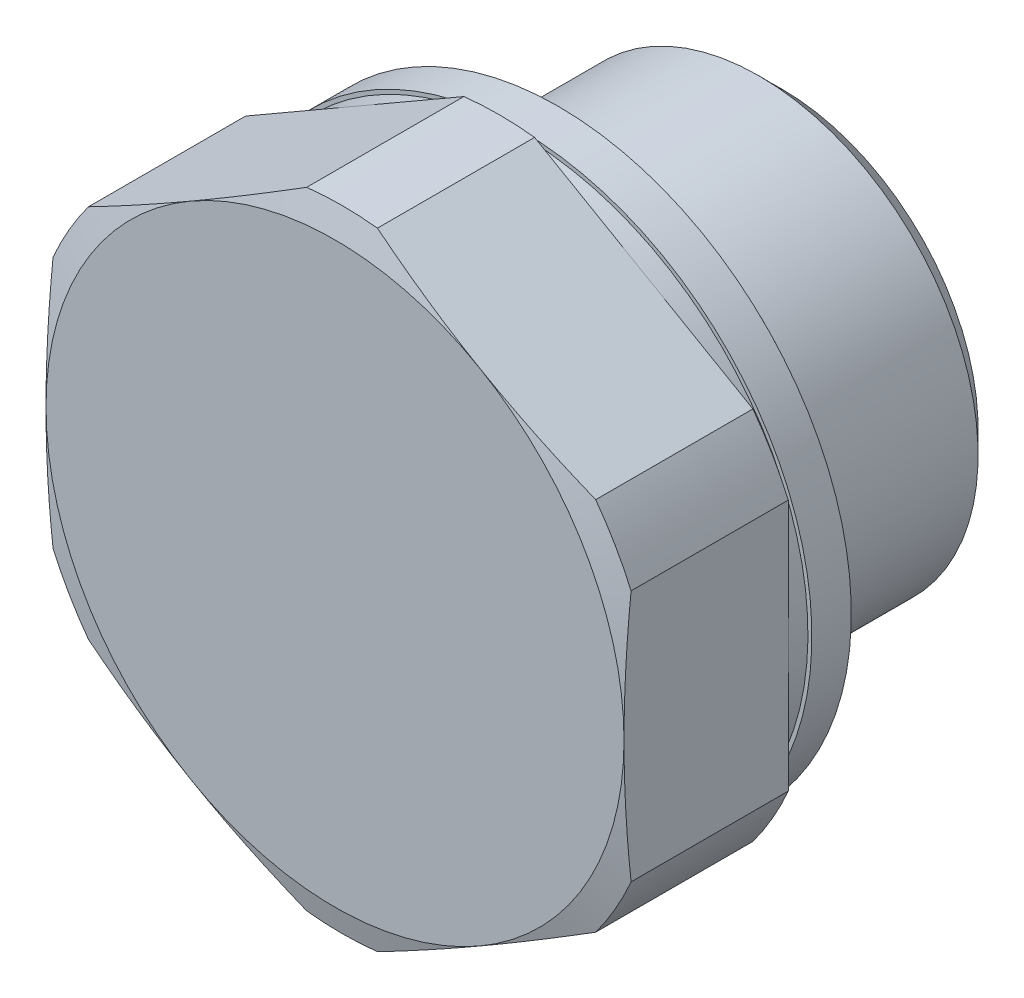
ISO-10303-21;
HEADER;
FILE_DESCRIPTION(('STEP AP214'),'2;1');
FILE_NAME('part.step','',(''),(''),'','','');
FILE_SCHEMA(('AUTOMOTIVE_DESIGN { 1 0 10303 214 1 1 1 1 }'));
ENDSEC;
DATA;
#1=APPLICATION_CONTEXT('core data for automotive mechanical design processes');
#2=APPLICATION_PROTOCOL_DEFINITION('international standard','automotive_design',2000,#1);
#3=PRODUCT_CONTEXT('',#1,'mechanical');
#4=PRODUCT('Part','Part','',(#3));
#5=PRODUCT_RELATED_PRODUCT_CATEGORY('part','',(#4));
#6=PRODUCT_DEFINITION_FORMATION('','',#4);
#7=PRODUCT_DEFINITION_CONTEXT('part definition',#1,'design');
#8=PRODUCT_DEFINITION('design','',#6,#7);
#9=PRODUCT_DEFINITION_SHAPE('','',#8);
#10=(LENGTH_UNIT() NAMED_UNIT(*) SI_UNIT(.MILLI.,.METRE.));
#11=(NAMED_UNIT(*) PLANE_ANGLE_UNIT() SI_UNIT($,.RADIAN.));
#12=(NAMED_UNIT(*) SI_UNIT($,.STERADIAN.) SOLID_ANGLE_UNIT());
#13=UNCERTAINTY_MEASURE_WITH_UNIT(LENGTH_MEASURE(1.E-05),#10,'distance_accuracy_value','');
#14=(GEOMETRIC_REPRESENTATION_CONTEXT(3) GLOBAL_UNCERTAINTY_ASSIGNED_CONTEXT((#13)) GLOBAL_UNIT_ASSIGNED_CONTEXT((#10,
#11,#12)) REPRESENTATION_CONTEXT('',''));
#15=CARTESIAN_POINT('',(0.,0.,0.));
#16=DIRECTION('',(0.,0.,1.));
#17=DIRECTION('',(1.,0.,0.));
#18=AXIS2_PLACEMENT_3D('',#15,#16,#17);
#19=CARTESIAN_POINT('',(0.,0.,-5.99999999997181));
#20=DIRECTION('',(0.,0.,-1.));
#21=DIRECTION('',(0.,1.,0.));
#22=AXIS2_PLACEMENT_3D('',#19,#20,#21);
#23=CONICAL_SURFACE('',#22,4.00000000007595,1.02974425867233);
#24=CARTESIAN_POINT('',(0.,0.,-3.5965575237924));
#25=VERTEX_POINT('',#24);
#26=VERTEX_LOOP('',#25);
#27=FACE_BOUND('',#26,.T.);
#28=CARTESIAN_POINT('',(0.,0.,-6.));
#29=DIRECTION('',(0.,0.,1.));
#30=DIRECTION('',(0.,-1.,0.));
#31=AXIS2_PLACEMENT_3D('',#28,#29,#30);
#32=CIRCLE('',#31,4.);
#33=CARTESIAN_POINT('',(0.,-4.,-6.));
#34=VERTEX_POINT('',#33);
#35=EDGE_CURVE('E410',#34,#34,#32,.F.);
#36=ORIENTED_EDGE('',*,*,#35,.T.);
#37=EDGE_LOOP('',(#36));
#38=FACE_BOUND('',#37,.T.);
#39=ADVANCED_FACE('F14',(#27,#38),#23,.F.);
#40=CARTESIAN_POINT('',(0.,0.,-10.));
#41=DIRECTION('',(0.,0.,1.));
#42=DIRECTION('',(0.,-1.,0.));
#43=AXIS2_PLACEMENT_3D('',#40,#41,#42);
#44=CYLINDRICAL_SURFACE('',#43,4.);
#45=CARTESIAN_POINT('',(0.,0.,-10.));
#46=DIRECTION('',(0.,0.,1.));
#47=DIRECTION('',(0.,-1.,0.));
#48=AXIS2_PLACEMENT_3D('',#45,#46,#47);
#49=CIRCLE('',#48,4.);
#50=CARTESIAN_POINT('',(0.,-4.,-10.));
#51=VERTEX_POINT('',#50);
#52=EDGE_CURVE('E17',#51,#51,#49,.F.);
#53=ORIENTED_EDGE('',*,*,#52,.T.);
#54=EDGE_LOOP('',(#53));
#55=FACE_BOUND('',#54,.T.);
#56=ORIENTED_EDGE('',*,*,#35,.F.);
#57=EDGE_LOOP('',(#56));
#58=FACE_BOUND('',#57,.T.);
#59=ADVANCED_FACE('F777',(#55,#58),#44,.F.);
#60=CARTESIAN_POINT('',(7.475,0.,-10.));
#61=DIRECTION('',(0.,0.,1.));
#62=DIRECTION('',(0.,-1.,0.));
#63=AXIS2_PLACEMENT_3D('',#60,#61,#62);
#64=PLANE('',#63);
#65=CARTESIAN_POINT('',(0.,0.,-10.));
#66=DIRECTION('',(0.,0.,1.));
#67=DIRECTION('',(0.,-1.,0.));
#68=AXIS2_PLACEMENT_3D('',#65,#66,#67);
#69=CIRCLE('',#68,7.475);
#70=CARTESIAN_POINT('',(0.,-7.475,-10.));
#71=VERTEX_POINT('',#70);
#72=EDGE_CURVE('E407',#71,#71,#69,.T.);
#73=ORIENTED_EDGE('',*,*,#72,.F.);
#74=EDGE_LOOP('',(#73));
#75=FACE_BOUND('',#74,.T.);
#76=ORIENTED_EDGE('',*,*,#52,.F.);
#77=EDGE_LOOP('',(#76));
#78=FACE_BOUND('',#77,.T.);
#79=ADVANCED_FACE('F768',(#75,#78),#64,.F.);
#80=CARTESIAN_POINT('',(0.,0.,-9.144));
#81=DIRECTION('',(0.,0.,1.));
#82=DIRECTION('',(0.,-1.,0.));
#83=AXIS2_PLACEMENT_3D('',#80,#81,#82);
#84=CONICAL_SURFACE('',#83,8.331,0.785398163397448);
#85=CARTESIAN_POINT('',(0.,0.,-9.144));
#86=DIRECTION('',(0.,0.,1.));
#87=DIRECTION('',(0.,-1.,0.));
#88=AXIS2_PLACEMENT_3D('',#85,#86,#87);
#89=CIRCLE('',#88,8.331);
#90=CARTESIAN_POINT('',(0.,-8.331,-9.144));
#91=VERTEX_POINT('',#90);
#92=EDGE_CURVE('E402',#91,#91,#89,.T.);
#93=ORIENTED_EDGE('',*,*,#92,.F.);
#94=EDGE_LOOP('',(#93));
#95=FACE_BOUND('',#94,.T.);
#96=ORIENTED_EDGE('',*,*,#72,.T.);
#97=EDGE_LOOP('',(#96));
#98=FACE_BOUND('',#97,.T.);
#99=ADVANCED_FACE('F759',(#95,#98),#84,.T.);
#100=CARTESIAN_POINT('',(0.,0.,-10.));
#101=DIRECTION('',(0.,0.,1.));
#102=DIRECTION('',(0.,-1.,0.));
#103=AXIS2_PLACEMENT_3D('',#100,#101,#102);
#104=CYLINDRICAL_SURFACE('',#103,8.331);
#105=CARTESIAN_POINT('',(0.,0.,-3.49421183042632));
#106=DIRECTION('',(0.,0.,-1.));
#107=DIRECTION('',(0.,1.,0.));
#108=AXIS2_PLACEMENT_3D('',#105,#106,#107);
#109=CIRCLE('',#108,8.331);
#110=CARTESIAN_POINT('',(0.,8.331,-3.49421183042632));
#111=VERTEX_POINT('',#110);
#112=EDGE_CURVE('E398',#111,#111,#109,.F.);
#113=ORIENTED_EDGE('',*,*,#112,.F.);
#114=EDGE_LOOP('',(#113));
#115=FACE_BOUND('',#114,.T.);
#116=ORIENTED_EDGE('',*,*,#92,.T.);
#117=EDGE_LOOP('',(#116));
#118=FACE_BOUND('',#117,.T.);
#119=ADVANCED_FACE('F750',(#115,#118),#104,.T.);
#120=CARTESIAN_POINT('',(0.,0.,-3.49421183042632));
#121=DIRECTION('',(0.,0.,-1.));
#122=DIRECTION('',(0.,1.,0.));
#123=AXIS2_PLACEMENT_3D('',#120,#121,#122);
#124=CONICAL_SURFACE('',#123,8.331,1.0471975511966);
#125=CARTESIAN_POINT('',(0.,0.,-3.));
#126=DIRECTION('',(0.,0.,-1.));
#127=DIRECTION('',(0.,1.,0.));
#128=AXIS2_PLACEMENT_3D('',#125,#126,#127);
#129=CIRCLE('',#128,7.475);
#130=CARTESIAN_POINT('',(0.,7.475,-3.));
#131=VERTEX_POINT('',#130);
#132=EDGE_CURVE('E401',#131,#131,#129,.T.);
#133=ORIENTED_EDGE('',*,*,#132,.T.);
#134=EDGE_LOOP('',(#133));
#135=FACE_BOUND('',#134,.T.);
#136=ORIENTED_EDGE('',*,*,#112,.T.);
#137=EDGE_LOOP('',(#136));
#138=FACE_BOUND('',#137,.T.);
#139=ADVANCED_FACE('F741',(#135,#138),#124,.T.);
#140=CARTESIAN_POINT('',(7.25,0.,-3.));
#141=DIRECTION('',(0.,0.,-1.));
#142=DIRECTION('',(0.,1.,0.));
#143=AXIS2_PLACEMENT_3D('',#140,#141,#142);
#144=PLANE('',#143);
#145=CARTESIAN_POINT('',(0.,0.,-3.));
#146=DIRECTION('',(0.,0.,1.));
#147=DIRECTION('',(-1.,0.,0.));
#148=AXIS2_PLACEMENT_3D('',#145,#146,#147);
#149=CIRCLE('',#148,7.25);
#150=CARTESIAN_POINT('',(-7.25,0.,-3.));
#151=VERTEX_POINT('',#150);
#152=EDGE_CURVE('E425',#151,#151,#149,.T.);
#153=ORIENTED_EDGE('',*,*,#152,.F.);
#154=EDGE_LOOP('',(#153));
#155=FACE_BOUND('',#154,.T.);
#156=ORIENTED_EDGE('',*,*,#132,.F.);
#157=EDGE_LOOP('',(#156));
#158=FACE_BOUND('',#157,.T.);
#159=ADVANCED_FACE('F732',(#155,#158),#144,.F.);
#160=CARTESIAN_POINT('',(0.,0.,0.));
#161=DIRECTION('',(0.,0.,1.));
#162=DIRECTION('',(-1.,0.,0.));
#163=AXIS2_PLACEMENT_3D('',#160,#161,#162);
#164=CONICAL_SURFACE('',#163,8.25,0.321750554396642);
#165=CARTESIAN_POINT('',(0.,0.,0.));
#166=DIRECTION('',(0.,0.,1.));
#167=DIRECTION('',(-1.,0.,0.));
#168=AXIS2_PLACEMENT_3D('',#165,#166,#167);
#169=CIRCLE('',#168,8.25);
#170=CARTESIAN_POINT('',(-8.25,0.,0.));
#171=VERTEX_POINT('',#170);
#172=EDGE_CURVE('E428',#171,#171,#169,.F.);
#173=ORIENTED_EDGE('',*,*,#172,.T.);
#174=EDGE_LOOP('',(#173));
#175=FACE_BOUND('',#174,.T.);
#176=ORIENTED_EDGE('',*,*,#152,.T.);
#177=EDGE_LOOP('',(#176));
#178=FACE_BOUND('',#177,.T.);
#179=ADVANCED_FACE('F723',(#175,#178),#164,.T.);
#180=CARTESIAN_POINT('',(11.,0.,0.));
#181=DIRECTION('',(0.,0.,1.));
#182=DIRECTION('',(0.,-1.,0.));
#183=AXIS2_PLACEMENT_3D('',#180,#181,#182);
#184=PLANE('',#183);
#185=CARTESIAN_POINT('',(0.,0.,0.));
#186=DIRECTION('',(0.,0.,1.));
#187=DIRECTION('',(0.,-1.,0.));
#188=AXIS2_PLACEMENT_3D('',#185,#186,#187);
#189=CIRCLE('',#188,8.331);
#190=CARTESIAN_POINT('',(0.,-8.331,0.));
#191=VERTEX_POINT('',#190);
#192=EDGE_CURVE('E431',#191,#191,#189,.F.);
#193=ORIENTED_EDGE('',*,*,#192,.T.);
#194=EDGE_LOOP('',(#193));
#195=FACE_BOUND('',#194,.T.);
#196=ORIENTED_EDGE('',*,*,#172,.F.);
#197=EDGE_LOOP('',(#196));
#198=FACE_BOUND('',#197,.T.);
#199=ADVANCED_FACE('F714',(#195,#198),#184,.F.);
#200=CARTESIAN_POINT('',(0.,0.,-1.5));
#201=DIRECTION('',(0.,0.,1.));
#202=DIRECTION('',(0.,-1.,0.));
#203=AXIS2_PLACEMENT_3D('',#200,#201,#202);
#204=CYLINDRICAL_SURFACE('',#203,8.331);
#205=ORIENTED_EDGE('',*,*,#192,.F.);
#206=EDGE_LOOP('',(#205));
#207=FACE_BOUND('',#206,.T.);
#208=CARTESIAN_POINT('',(0.,0.,-1.5));
#209=DIRECTION('',(0.,0.,1.));
#210=DIRECTION('',(0.,-1.,0.));
#211=AXIS2_PLACEMENT_3D('',#208,#209,#210);
#212=CIRCLE('',#211,8.331);
#213=CARTESIAN_POINT('',(0.,-8.331,-1.5));
#214=VERTEX_POINT('',#213);
#215=EDGE_CURVE('E434',#214,#214,#212,.T.);
#216=ORIENTED_EDGE('',*,*,#215,.F.);
#217=EDGE_LOOP('',(#216));
#218=FACE_BOUND('',#217,.T.);
#219=ADVANCED_FACE('F705',(#207,#218),#204,.F.);
#220=CARTESIAN_POINT('',(8.331,0.,-1.5));
#221=DIRECTION('',(0.,0.,-1.));
#222=DIRECTION('',(0.,1.,0.));
#223=AXIS2_PLACEMENT_3D('',#220,#221,#222);
#224=PLANE('',#223);
#225=ORIENTED_EDGE('',*,*,#215,.T.);
#226=EDGE_LOOP('',(#225));
#227=FACE_BOUND('',#226,.T.);
#228=CARTESIAN_POINT('',(0.,0.,-1.5));
#229=DIRECTION('',(0.,0.,1.));
#230=DIRECTION('',(0.,-1.,0.));
#231=AXIS2_PLACEMENT_3D('',#228,#229,#230);
#232=CIRCLE('',#231,11.15);
#233=CARTESIAN_POINT('',(0.,-11.15,-1.5));
#234=VERTEX_POINT('',#233);
#235=EDGE_CURVE('E437',#234,#234,#232,.T.);
#236=ORIENTED_EDGE('',*,*,#235,.F.);
#237=EDGE_LOOP('',(#236));
#238=FACE_BOUND('',#237,.T.);
#239=ADVANCED_FACE('F696',(#227,#238),#224,.T.);
#240=CARTESIAN_POINT('',(0.,0.,-1.5));
#241=DIRECTION('',(0.,0.,1.));
#242=DIRECTION('',(0.,-1.,0.));
#243=AXIS2_PLACEMENT_3D('',#240,#241,#242);
#244=CYLINDRICAL_SURFACE('',#243,11.15);
#245=ORIENTED_EDGE('',*,*,#235,.T.);
#246=EDGE_LOOP('',(#245));
#247=FACE_BOUND('',#246,.T.);
#248=CARTESIAN_POINT('',(0.,0.,0.));
#249=DIRECTION('',(0.,0.,1.));
#250=DIRECTION('',(0.,-1.,0.));
#251=AXIS2_PLACEMENT_3D('',#248,#249,#250);
#252=CIRCLE('',#251,11.15);
#253=CARTESIAN_POINT('',(0.,-11.15,0.));
#254=VERTEX_POINT('',#253);
#255=EDGE_CURVE('E440',#254,#254,#252,.T.);
#256=ORIENTED_EDGE('',*,*,#255,.F.);
#257=EDGE_LOOP('',(#256));
#258=FACE_BOUND('',#257,.T.);
#259=ADVANCED_FACE('F687',(#247,#258),#244,.T.);
#260=CARTESIAN_POINT('',(11.15,0.,0.));
#261=DIRECTION('',(0.,0.,1.));
#262=DIRECTION('',(0.,-1.,0.));
#263=AXIS2_PLACEMENT_3D('',#260,#261,#262);
#264=PLANE('',#263);
#265=ORIENTED_EDGE('',*,*,#255,.T.);
#266=EDGE_LOOP('',(#265));
#267=FACE_BOUND('',#266,.T.);
#268=CARTESIAN_POINT('',(0.,0.,0.));
#269=DIRECTION('',(0.,0.,1.));
#270=DIRECTION('',(0.,-1.,0.));
#271=AXIS2_PLACEMENT_3D('',#268,#269,#270);
#272=CIRCLE('',#271,11.);
#273=CARTESIAN_POINT('',(0.,-11.,0.));
#274=VERTEX_POINT('',#273);
#275=EDGE_CURVE('E443',#274,#274,#272,.T.);
#276=ORIENTED_EDGE('',*,*,#275,.F.);
#277=EDGE_LOOP('',(#276));
#278=FACE_BOUND('',#277,.T.);
#279=ADVANCED_FACE('F679',(#267,#278),#264,.T.);
#280=CARTESIAN_POINT('',(0.,0.,-10.));
#281=DIRECTION('',(0.,0.,1.));
#282=DIRECTION('',(0.,-1.,0.));
#283=AXIS2_PLACEMENT_3D('',#280,#281,#282);
#284=CYLINDRICAL_SURFACE('',#283,11.);
#285=CARTESIAN_POINT('',(0.,0.,0.75));
#286=DIRECTION('',(0.,0.,1.));
#287=DIRECTION('',(0.,-1.,0.));
#288=AXIS2_PLACEMENT_3D('',#285,#286,#287);
#289=CIRCLE('',#288,11.);
#290=CARTESIAN_POINT('',(-5.5,9.52627944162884,0.75));
#291=VERTEX_POINT('',#290);
#292=CARTESIAN_POINT('',(5.5,9.52627944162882,0.75));
#293=VERTEX_POINT('',#292);
#294=EDGE_CURVE('E450',#291,#293,#289,.F.);
#295=ORIENTED_EDGE('',*,*,#294,.T.);
#296=CARTESIAN_POINT('',(0.,0.,0.75));
#297=DIRECTION('',(0.,0.,1.));
#298=DIRECTION('',(0.,-1.,0.));
#299=AXIS2_PLACEMENT_3D('',#296,#297,#298);
#300=CIRCLE('',#299,11.);
#301=CARTESIAN_POINT('',(11.,0.,0.75));
#302=VERTEX_POINT('',#301);
#303=EDGE_CURVE('E453',#293,#302,#300,.F.);
#304=ORIENTED_EDGE('',*,*,#303,.T.);
#305=CARTESIAN_POINT('',(0.,0.,0.75));
#306=DIRECTION('',(0.,0.,1.));
#307=DIRECTION('',(0.,-1.,0.));
#308=AXIS2_PLACEMENT_3D('',#305,#306,#307);
#309=CIRCLE('',#308,11.);
#310=CARTESIAN_POINT('',(5.5,-9.52627944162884,0.75));
#311=VERTEX_POINT('',#310);
#312=EDGE_CURVE('E456',#302,#311,#309,.F.);
#313=ORIENTED_EDGE('',*,*,#312,.T.);
#314=CARTESIAN_POINT('',(0.,0.,0.75));
#315=DIRECTION('',(0.,0.,1.));
#316=DIRECTION('',(0.,-1.,0.));
#317=AXIS2_PLACEMENT_3D('',#314,#315,#316);
#318=CIRCLE('',#317,11.);
#319=CARTESIAN_POINT('',(-5.5,-9.52627944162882,0.75));
#320=VERTEX_POINT('',#319);
#321=EDGE_CURVE('E459',#311,#320,#318,.F.);
#322=ORIENTED_EDGE('',*,*,#321,.T.);
#323=CARTESIAN_POINT('',(0.,0.,0.75));
#324=DIRECTION('',(0.,0.,1.));
#325=DIRECTION('',(0.,-1.,0.));
#326=AXIS2_PLACEMENT_3D('',#323,#324,#325);
#327=CIRCLE('',#326,11.);
#328=CARTESIAN_POINT('',(-11.,0.,0.75));
#329=VERTEX_POINT('',#328);
#330=EDGE_CURVE('E136',#320,#329,#327,.F.);
#331=ORIENTED_EDGE('',*,*,#330,.T.);
#332=CARTESIAN_POINT('',(0.,0.,0.75));
#333=DIRECTION('',(0.,0.,1.));
#334=DIRECTION('',(0.,-1.,0.));
#335=AXIS2_PLACEMENT_3D('',#332,#333,#334);
#336=CIRCLE('',#335,11.);
#337=EDGE_CURVE('E447',#329,#291,#336,.F.);
#338=ORIENTED_EDGE('',*,*,#337,.T.);
#339=EDGE_LOOP('',(#295,#304,#313,#322,#331,#338));
#340=FACE_BOUND('',#339,.T.);
#341=ORIENTED_EDGE('',*,*,#275,.T.);
#342=EDGE_LOOP('',(#341));
#343=FACE_BOUND('',#342,.T.);
#344=ADVANCED_FACE('F480',(#340,#343),#284,.T.);
#345=CARTESIAN_POINT('',(15.,0.,0.75));
#346=DIRECTION('',(0.,0.,1.));
#347=DIRECTION('',(0.,-1.,0.));
#348=AXIS2_PLACEMENT_3D('',#345,#346,#347);
#349=PLANE('',#348);
#350=DIRECTION('',(0.,-1.,0.));
#351=VECTOR('',#350,1.);
#352=CARTESIAN_POINT('',(-11.,6.35085296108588,0.75));
#353=LINE('',#352,#351);
#354=CARTESIAN_POINT('',(-11.,-4.79583152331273,0.75));
#355=VERTEX_POINT('',#354);
#356=EDGE_CURVE('E387',#329,#355,#353,.T.);
#357=ORIENTED_EDGE('',*,*,#356,.F.);
#358=ORIENTED_EDGE('',*,*,#330,.F.);
#359=DIRECTION('',(0.866025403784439,-0.5,0.));
#360=VECTOR('',#359,1.);
#361=CARTESIAN_POINT('',(-11.,-6.35085296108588,0.75));
#362=LINE('',#361,#360);
#363=CARTESIAN_POINT('',(-9.65331193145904,-7.12836367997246,0.75));
#364=VERTEX_POINT('',#363);
#365=EDGE_CURVE('E391',#364,#320,#362,.T.);
#366=ORIENTED_EDGE('',*,*,#365,.F.);
#367=CARTESIAN_POINT('',(0.,0.,0.75));
#368=DIRECTION('',(0.,0.,-1.));
#369=DIRECTION('',(0.,1.,0.));
#370=AXIS2_PLACEMENT_3D('',#367,#368,#369);
#371=CIRCLE('',#370,12.);
#372=EDGE_CURVE('E397',#355,#364,#371,.F.);
#373=ORIENTED_EDGE('',*,*,#372,.F.);
#374=EDGE_LOOP('',(#357,#358,#366,#373));
#375=FACE_BOUND('',#374,.T.);
#376=ADVANCED_FACE('F663',(#375),#349,.F.);
#377=CARTESIAN_POINT('',(15.,0.,0.75));
#378=DIRECTION('',(0.,0.,1.));
#379=DIRECTION('',(0.,-1.,0.));
#380=AXIS2_PLACEMENT_3D('',#377,#378,#379);
#381=PLANE('',#380);
#382=DIRECTION('',(-0.866025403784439,-0.5,0.));
#383=VECTOR('',#382,1.);
#384=CARTESIAN_POINT('',(0.,12.7017059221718,0.75));
#385=LINE('',#384,#383);
#386=CARTESIAN_POINT('',(-9.65331193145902,7.12836367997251,0.75));
#387=VERTEX_POINT('',#386);
#388=EDGE_CURVE('E379',#291,#387,#385,.T.);
#389=ORIENTED_EDGE('',*,*,#388,.F.);
#390=ORIENTED_EDGE('',*,*,#337,.F.);
#391=DIRECTION('',(0.,-1.,0.));
#392=VECTOR('',#391,1.);
#393=CARTESIAN_POINT('',(-11.,6.35085296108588,0.75));
#394=LINE('',#393,#392);
#395=CARTESIAN_POINT('',(-11.,4.79583152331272,0.75));
#396=VERTEX_POINT('',#395);
#397=EDGE_CURVE('E383',#396,#329,#394,.T.);
#398=ORIENTED_EDGE('',*,*,#397,.F.);
#399=CARTESIAN_POINT('',(0.,0.,0.75));
#400=DIRECTION('',(0.,0.,-1.));
#401=DIRECTION('',(0.,1.,0.));
#402=AXIS2_PLACEMENT_3D('',#399,#400,#401);
#403=CIRCLE('',#402,12.);
#404=EDGE_CURVE('E390',#387,#396,#403,.F.);
#405=ORIENTED_EDGE('',*,*,#404,.F.);
#406=EDGE_LOOP('',(#389,#390,#398,#405));
#407=FACE_BOUND('',#406,.T.);
#408=ADVANCED_FACE('F655',(#407),#381,.F.);
#409=CARTESIAN_POINT('',(15.,0.,0.75));
#410=DIRECTION('',(0.,0.,1.));
#411=DIRECTION('',(0.,-1.,0.));
#412=AXIS2_PLACEMENT_3D('',#409,#410,#411);
#413=PLANE('',#412);
#414=DIRECTION('',(-0.866025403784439,0.5,0.));
#415=VECTOR('',#414,1.);
#416=CARTESIAN_POINT('',(11.,6.35085296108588,0.75));
#417=LINE('',#416,#415);
#418=CARTESIAN_POINT('',(1.34668806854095,11.9241952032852,0.75));
#419=VERTEX_POINT('',#418);
#420=EDGE_CURVE('E371',#293,#419,#417,.T.);
#421=ORIENTED_EDGE('',*,*,#420,.F.);
#422=ORIENTED_EDGE('',*,*,#294,.F.);
#423=DIRECTION('',(-0.866025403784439,-0.5,0.));
#424=VECTOR('',#423,1.);
#425=CARTESIAN_POINT('',(0.,12.7017059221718,0.75));
#426=LINE('',#425,#424);
#427=CARTESIAN_POINT('',(-1.346688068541,11.9241952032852,0.75));
#428=VERTEX_POINT('',#427);
#429=EDGE_CURVE('E375',#428,#291,#426,.T.);
#430=ORIENTED_EDGE('',*,*,#429,.F.);
#431=CARTESIAN_POINT('',(0.,0.,0.75));
#432=DIRECTION('',(0.,0.,-1.));
#433=DIRECTION('',(0.,1.,0.));
#434=AXIS2_PLACEMENT_3D('',#431,#432,#433);
#435=CIRCLE('',#434,12.);
#436=EDGE_CURVE('E382',#419,#428,#435,.F.);
#437=ORIENTED_EDGE('',*,*,#436,.F.);
#438=EDGE_LOOP('',(#421,#422,#430,#437));
#439=FACE_BOUND('',#438,.T.);
#440=ADVANCED_FACE('F485',(#439),#413,.F.);
#441=CARTESIAN_POINT('',(15.,0.,0.75));
#442=DIRECTION('',(0.,0.,1.));
#443=DIRECTION('',(0.,-1.,0.));
#444=AXIS2_PLACEMENT_3D('',#441,#442,#443);
#445=PLANE('',#444);
#446=DIRECTION('',(0.,1.,0.));
#447=VECTOR('',#446,1.);
#448=CARTESIAN_POINT('',(11.,-6.35085296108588,0.75));
#449=LINE('',#448,#447);
#450=CARTESIAN_POINT('',(11.,4.79583152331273,0.75));
#451=VERTEX_POINT('',#450);
#452=EDGE_CURVE('E365',#302,#451,#449,.T.);
#453=ORIENTED_EDGE('',*,*,#452,.F.);
#454=ORIENTED_EDGE('',*,*,#303,.F.);
#455=DIRECTION('',(-0.866025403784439,0.5,0.));
#456=VECTOR('',#455,1.);
#457=CARTESIAN_POINT('',(11.,6.35085296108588,0.75));
#458=LINE('',#457,#456);
#459=CARTESIAN_POINT('',(9.65331193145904,7.12836367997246,0.75));
#460=VERTEX_POINT('',#459);
#461=EDGE_CURVE('E367',#460,#293,#458,.T.);
#462=ORIENTED_EDGE('',*,*,#461,.F.);
#463=CARTESIAN_POINT('',(0.,0.,0.75));
#464=DIRECTION('',(0.,0.,-1.));
#465=DIRECTION('',(0.,1.,0.));
#466=AXIS2_PLACEMENT_3D('',#463,#464,#465);
#467=CIRCLE('',#466,12.);
#468=EDGE_CURVE('E374',#451,#460,#467,.F.);
#469=ORIENTED_EDGE('',*,*,#468,.F.);
#470=EDGE_LOOP('',(#453,#454,#462,#469));
#471=FACE_BOUND('',#470,.T.);
#472=ADVANCED_FACE('F478',(#471),#445,.F.);
#473=CARTESIAN_POINT('',(15.,0.,0.75));
#474=DIRECTION('',(0.,0.,1.));
#475=DIRECTION('',(0.,-1.,0.));
#476=AXIS2_PLACEMENT_3D('',#473,#474,#475);
#477=PLANE('',#476);
#478=DIRECTION('',(0.866025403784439,0.5,0.));
#479=VECTOR('',#478,1.);
#480=CARTESIAN_POINT('',(0.,-12.7017059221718,0.75));
#481=LINE('',#480,#479);
#482=CARTESIAN_POINT('',(9.65331193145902,-7.12836367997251,0.75));
#483=VERTEX_POINT('',#482);
#484=EDGE_CURVE('E362',#311,#483,#481,.T.);
#485=ORIENTED_EDGE('',*,*,#484,.F.);
#486=ORIENTED_EDGE('',*,*,#312,.F.);
#487=DIRECTION('',(0.,1.,0.));
#488=VECTOR('',#487,1.);
#489=CARTESIAN_POINT('',(11.,-6.35085296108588,0.75));
#490=LINE('',#489,#488);
#491=CARTESIAN_POINT('',(11.,-4.79583152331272,0.75));
#492=VERTEX_POINT('',#491);
#493=EDGE_CURVE('E163',#492,#302,#490,.T.);
#494=ORIENTED_EDGE('',*,*,#493,.F.);
#495=CARTESIAN_POINT('',(0.,0.,0.75));
#496=DIRECTION('',(0.,0.,-1.));
#497=DIRECTION('',(0.,1.,0.));
#498=AXIS2_PLACEMENT_3D('',#495,#496,#497);
#499=CIRCLE('',#498,12.);
#500=EDGE_CURVE('E159',#483,#492,#499,.F.);
#501=ORIENTED_EDGE('',*,*,#500,.F.);
#502=EDGE_LOOP('',(#485,#486,#494,#501));
#503=FACE_BOUND('',#502,.T.);
#504=ADVANCED_FACE('F631',(#503),#477,.F.);
#505=CARTESIAN_POINT('',(15.,0.,0.75));
#506=DIRECTION('',(0.,0.,1.));
#507=DIRECTION('',(0.,-1.,0.));
#508=AXIS2_PLACEMENT_3D('',#505,#506,#507);
#509=PLANE('',#508);
#510=DIRECTION('',(0.866025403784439,-0.5,0.));
#511=VECTOR('',#510,1.);
#512=CARTESIAN_POINT('',(-11.,-6.35085296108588,0.75));
#513=LINE('',#512,#511);
#514=CARTESIAN_POINT('',(-1.34668806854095,-11.9241952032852,0.75));
#515=VERTEX_POINT('',#514);
#516=EDGE_CURVE('E395',#320,#515,#513,.T.);
#517=ORIENTED_EDGE('',*,*,#516,.F.);
#518=ORIENTED_EDGE('',*,*,#321,.F.);
#519=DIRECTION('',(0.866025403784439,0.5,0.));
#520=VECTOR('',#519,1.);
#521=CARTESIAN_POINT('',(0.,-12.7017059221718,0.75));
#522=LINE('',#521,#520);
#523=CARTESIAN_POINT('',(1.346688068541,-11.9241952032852,0.75));
#524=VERTEX_POINT('',#523);
#525=EDGE_CURVE('E355',#524,#311,#522,.T.);
#526=ORIENTED_EDGE('',*,*,#525,.F.);
#527=CARTESIAN_POINT('',(0.,0.,0.75));
#528=DIRECTION('',(0.,0.,-1.));
#529=DIRECTION('',(0.,1.,0.));
#530=AXIS2_PLACEMENT_3D('',#527,#528,#529);
#531=CIRCLE('',#530,12.);
#532=EDGE_CURVE('E461',#515,#524,#531,.F.);
#533=ORIENTED_EDGE('',*,*,#532,.F.);
#534=EDGE_LOOP('',(#517,#518,#526,#533));
#535=FACE_BOUND('',#534,.T.);
#536=ADVANCED_FACE('F624',(#535),#509,.F.);
#537=CARTESIAN_POINT('',(0.,0.,0.));
#538=DIRECTION('',(0.,0.,-1.));
#539=DIRECTION('',(0.,1.,0.));
#540=AXIS2_PLACEMENT_3D('',#537,#538,#539);
#541=CYLINDRICAL_SURFACE('',#540,12.);
#542=CARTESIAN_POINT('',(0.,0.,6.73205080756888));
#543=DIRECTION('',(0.,0.,-1.));
#544=DIRECTION('',(0.,1.,0.));
#545=AXIS2_PLACEMENT_3D('',#542,#543,#544);
#546=CIRCLE('',#545,12.);
#547=CARTESIAN_POINT('',(-1.34668806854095,-11.9241952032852,6.73205080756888));
#548=VERTEX_POINT('',#547);
#549=CARTESIAN_POINT('',(1.34668806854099,-11.9241952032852,6.73205080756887));
#550=VERTEX_POINT('',#549);
#551=EDGE_CURVE('E354',#548,#550,#546,.F.);
#552=ORIENTED_EDGE('',*,*,#551,.F.);
#553=DIRECTION('',(0.,0.,1.));
#554=VECTOR('',#553,1.);
#555=CARTESIAN_POINT('',(-1.34668806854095,-11.9241952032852,0.));
#556=LINE('',#555,#554);
#557=EDGE_CURVE('E359',#515,#548,#556,.T.);
#558=ORIENTED_EDGE('',*,*,#557,.F.);
#559=ORIENTED_EDGE('',*,*,#532,.T.);
#560=DIRECTION('',(0.,0.,1.));
#561=VECTOR('',#560,1.);
#562=CARTESIAN_POINT('',(1.34668806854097,-11.9241952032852,0.));
#563=LINE('',#562,#561);
#564=EDGE_CURVE('E352',#550,#524,#563,.F.);
#565=ORIENTED_EDGE('',*,*,#564,.F.);
#566=EDGE_LOOP('',(#552,#558,#559,#565));
#567=FACE_BOUND('',#566,.T.);
#568=ADVANCED_FACE('F508',(#567),#541,.T.);
#569=CARTESIAN_POINT('',(0.,0.,0.));
#570=DIRECTION('',(0.,0.,-1.));
#571=DIRECTION('',(0.,1.,0.));
#572=AXIS2_PLACEMENT_3D('',#569,#570,#571);
#573=CYLINDRICAL_SURFACE('',#572,12.);
#574=CARTESIAN_POINT('',(0.,0.,6.73205080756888));
#575=DIRECTION('',(0.,0.,-1.));
#576=DIRECTION('',(0.,1.,0.));
#577=AXIS2_PLACEMENT_3D('',#574,#575,#576);
#578=CIRCLE('',#577,12.);
#579=CARTESIAN_POINT('',(-11.,-4.79583152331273,6.73205080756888));
#580=VERTEX_POINT('',#579);
#581=CARTESIAN_POINT('',(-9.65331193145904,-7.12836367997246,6.73205080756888));
#582=VERTEX_POINT('',#581);
#583=EDGE_CURVE('E300',#580,#582,#578,.F.);
#584=ORIENTED_EDGE('',*,*,#583,.F.);
#585=DIRECTION('',(0.,0.,1.));
#586=VECTOR('',#585,1.);
#587=CARTESIAN_POINT('',(-11.,-4.79583152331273,0.));
#588=LINE('',#587,#586);
#589=EDGE_CURVE('E389',#355,#580,#588,.T.);
#590=ORIENTED_EDGE('',*,*,#589,.F.);
#591=ORIENTED_EDGE('',*,*,#372,.T.);
#592=DIRECTION('',(0.,0.,1.));
#593=VECTOR('',#592,1.);
#594=CARTESIAN_POINT('',(-9.65331193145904,-7.12836367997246,0.));
#595=LINE('',#594,#593);
#596=EDGE_CURVE('E394',#582,#364,#595,.F.);
#597=ORIENTED_EDGE('',*,*,#596,.F.);
#598=EDGE_LOOP('',(#584,#590,#591,#597));
#599=FACE_BOUND('',#598,.T.);
#600=ADVANCED_FACE('F283',(#599),#573,.T.);
#601=CARTESIAN_POINT('',(-11.,-6.35085296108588,0.));
#602=DIRECTION('',(-0.5,-0.866025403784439,0.));
#603=DIRECTION('',(0.866025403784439,-0.5,0.));
#604=AXIS2_PLACEMENT_3D('',#601,#602,#603);
#605=PLANE('',#604);
#606=ORIENTED_EDGE('',*,*,#596,.T.);
#607=ORIENTED_EDGE('',*,*,#365,.T.);
#608=ORIENTED_EDGE('',*,*,#516,.T.);
#609=ORIENTED_EDGE('',*,*,#557,.T.);
#610=CARTESIAN_POINT('',(-5.5,-9.52627944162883,7.));
#611=CARTESIAN_POINT('',(-5.32651772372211,-9.62643948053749,7.00000399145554));
#612=CARTESIAN_POINT('',(-5.15303815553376,-9.72659795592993,6.9985334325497));
#613=CARTESIAN_POINT('',(-4.80611764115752,-9.92689260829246,6.99267661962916));
#614=CARTESIAN_POINT('',(-4.63267669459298,-10.02702878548,6.98829039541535));
#615=CARTESIAN_POINT('',(-4.11271479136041,-10.3272289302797,6.97081697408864));
#616=CARTESIAN_POINT('',(-3.76629605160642,-10.527233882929,6.9534149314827));
#617=CARTESIAN_POINT('',(-3.07404295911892,-10.926906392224,6.90772760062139));
#618=CARTESIAN_POINT('',(-2.7282085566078,-11.1265739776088,6.87944329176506));
#619=CARTESIAN_POINT('',(-2.03700011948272,-11.5256433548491,6.81294953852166));
#620=CARTESIAN_POINT('',(-1.69162660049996,-11.7250448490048,6.77473291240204));
#621=CARTESIAN_POINT('',(-1.34668806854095,-11.9241952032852,6.73205080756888));
#622=B_SPLINE_CURVE_WITH_KNOTS('',3,(#610,#611,#612,#613,#614,#615,#616,#617,#618,#619,#620,
#621),.UNSPECIFIED.,.F.,.F.,(4,2,2,2,2,4),(0.,0.60094877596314,1.2018914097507,2.40288078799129,
3.60376210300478,4.80551416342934),.UNSPECIFIED.);
#623=CARTESIAN_POINT('',(-5.5,-9.52627944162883,7.));
#624=VERTEX_POINT('',#623);
#625=EDGE_CURVE('E293',#624,#548,#622,.T.);
#626=ORIENTED_EDGE('',*,*,#625,.F.);
#627=CARTESIAN_POINT('',(-9.65331193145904,-7.12836367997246,6.73205080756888));
#628=CARTESIAN_POINT('',(-9.30837339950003,-7.32751403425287,6.77473291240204));
#629=CARTESIAN_POINT('',(-8.96299988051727,-7.52691552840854,6.81294953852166));
#630=CARTESIAN_POINT('',(-8.27179144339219,-7.92598490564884,6.87944329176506));
#631=CARTESIAN_POINT('',(-7.92595704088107,-8.12565249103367,6.90772760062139));
#632=CARTESIAN_POINT('',(-7.23370394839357,-8.52532500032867,6.9534149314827));
#633=CARTESIAN_POINT('',(-6.88728520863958,-8.72532995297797,6.97081697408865));
#634=CARTESIAN_POINT('',(-6.367323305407,-9.02553009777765,6.98829039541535));
#635=CARTESIAN_POINT('',(-6.19388235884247,-9.12566627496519,6.99267661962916));
#636=CARTESIAN_POINT('',(-5.84696184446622,-9.32596092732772,6.9985334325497));
#637=CARTESIAN_POINT('',(-5.67348227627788,-9.42611940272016,7.00000399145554));
#638=CARTESIAN_POINT('',(-5.5,-9.52627944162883,7.));
#639=B_SPLINE_CURVE_WITH_KNOTS('',3,(#627,#628,#629,#630,#631,#632,#633,#634,#635,#636,#637,
#638),.UNSPECIFIED.,.F.,.F.,(4,2,2,2,2,4),(0.,1.20175206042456,2.40263337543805,
3.60362275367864,4.2045653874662,4.80551416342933),.UNSPECIFIED.);
#640=EDGE_CURVE('E287',#582,#624,#639,.T.);
#641=ORIENTED_EDGE('',*,*,#640,.F.);
#642=EDGE_LOOP('',(#606,#607,#608,#609,#626,#641));
#643=FACE_BOUND('',#642,.T.);
#644=ADVANCED_FACE('F278',(#643),#605,.T.);
#645=CARTESIAN_POINT('',(0.,0.,0.));
#646=DIRECTION('',(0.,0.,-1.));
#647=DIRECTION('',(0.,1.,0.));
#648=AXIS2_PLACEMENT_3D('',#645,#646,#647);
#649=CYLINDRICAL_SURFACE('',#648,12.);
#650=CARTESIAN_POINT('',(0.,0.,6.73205080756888));
#651=DIRECTION('',(0.,0.,-1.));
#652=DIRECTION('',(0.,1.,0.));
#653=AXIS2_PLACEMENT_3D('',#650,#651,#652);
#654=CIRCLE('',#653,12.);
#655=CARTESIAN_POINT('',(-9.65331193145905,7.12836367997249,6.73205080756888));
#656=VERTEX_POINT('',#655);
#657=CARTESIAN_POINT('',(-11.,4.79583152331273,6.73205080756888));
#658=VERTEX_POINT('',#657);
#659=EDGE_CURVE('E260',#656,#658,#654,.F.);
#660=ORIENTED_EDGE('',*,*,#659,.F.);
#661=DIRECTION('',(0.,0.,1.));
#662=VECTOR('',#661,1.);
#663=CARTESIAN_POINT('',(-9.65331193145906,7.12836367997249,0.));
#664=LINE('',#663,#662);
#665=EDGE_CURVE('E381',#387,#656,#664,.T.);
#666=ORIENTED_EDGE('',*,*,#665,.F.);
#667=ORIENTED_EDGE('',*,*,#404,.T.);
#668=DIRECTION('',(0.,0.,1.));
#669=VECTOR('',#668,1.);
#670=CARTESIAN_POINT('',(-11.,4.79583152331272,0.));
#671=LINE('',#670,#669);
#672=EDGE_CURVE('E386',#658,#396,#671,.F.);
#673=ORIENTED_EDGE('',*,*,#672,.F.);
#674=EDGE_LOOP('',(#660,#666,#667,#673));
#675=FACE_BOUND('',#674,.T.);
#676=ADVANCED_FACE('F273',(#675),#649,.T.);
#677=CARTESIAN_POINT('',(-11.,6.35085296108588,0.));
#678=DIRECTION('',(-1.,0.,0.));
#679=DIRECTION('',(0.,-1.,0.));
#680=AXIS2_PLACEMENT_3D('',#677,#678,#679);
#681=PLANE('',#680);
#682=ORIENTED_EDGE('',*,*,#672,.T.);
#683=ORIENTED_EDGE('',*,*,#397,.T.);
#684=ORIENTED_EDGE('',*,*,#356,.T.);
#685=ORIENTED_EDGE('',*,*,#589,.T.);
#686=CARTESIAN_POINT('',(-11.,0.,7.));
#687=CARTESIAN_POINT('',(-11.,-0.200320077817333,7.00000399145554));
#688=CARTESIAN_POINT('',(-11.,-0.400637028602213,6.9985334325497));
#689=CARTESIAN_POINT('',(-11.,-0.801226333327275,6.99267661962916));
#690=CARTESIAN_POINT('',(-11.,-1.00149868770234,6.98829039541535));
#691=CARTESIAN_POINT('',(-11.,-1.6018989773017,6.97081697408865));
#692=CARTESIAN_POINT('',(-11.,-2.00190888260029,6.9534149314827));
#693=CARTESIAN_POINT('',(-11.,-2.8012539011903,6.90772760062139));
#694=CARTESIAN_POINT('',(-11.,-3.20058907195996,6.87944329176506));
#695=CARTESIAN_POINT('',(-11.,-3.99872782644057,6.81294953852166));
#696=CARTESIAN_POINT('',(-11.,-4.3975308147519,6.77473291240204));
#697=CARTESIAN_POINT('',(-11.,-4.79583152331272,6.73205080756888));
#698=B_SPLINE_CURVE_WITH_KNOTS('',3,(#686,#687,#688,#689,#690,#691,#692,#693,#694,#695,#696,
#697),.UNSPECIFIED.,.F.,.F.,(4,2,2,2,2,4),(0.,0.600948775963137,1.20189140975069,
2.40288078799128,3.60376210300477,4.80551416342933),.UNSPECIFIED.);
#699=CARTESIAN_POINT('',(-11.,0.,7.));
#700=VERTEX_POINT('',#699);
#701=EDGE_CURVE('E261',#700,#580,#698,.T.);
#702=ORIENTED_EDGE('',*,*,#701,.F.);
#703=CARTESIAN_POINT('',(-11.,4.79583152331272,6.73205080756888));
#704=CARTESIAN_POINT('',(-11.,4.3975308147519,6.77473291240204));
#705=CARTESIAN_POINT('',(-11.,3.99872782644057,6.81294953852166));
#706=CARTESIAN_POINT('',(-11.,3.20058907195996,6.87944329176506));
#707=CARTESIAN_POINT('',(-11.,2.8012539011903,6.90772760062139));
#708=CARTESIAN_POINT('',(-11.,2.00190888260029,6.9534149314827));
#709=CARTESIAN_POINT('',(-11.,1.6018989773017,6.97081697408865));
#710=CARTESIAN_POINT('',(-11.,1.00149868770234,6.98829039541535));
#711=CARTESIAN_POINT('',(-11.,0.801226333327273,6.99267661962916));
#712=CARTESIAN_POINT('',(-11.,0.400637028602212,6.9985334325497));
#713=CARTESIAN_POINT('',(-11.,0.200320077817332,7.00000399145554));
#714=CARTESIAN_POINT('',(-11.,0.,7.));
#715=B_SPLINE_CURVE_WITH_KNOTS('',3,(#703,#704,#705,#706,#707,#708,#709,#710,#711,#712,#713,
#714),.UNSPECIFIED.,.F.,.F.,(4,2,2,2,2,4),(0.,1.20175206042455,2.40263337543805,
3.60362275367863,4.20456538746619,4.80551416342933),.UNSPECIFIED.);
#716=EDGE_CURVE('E253',#658,#700,#715,.T.);
#717=ORIENTED_EDGE('',*,*,#716,.F.);
#718=EDGE_LOOP('',(#682,#683,#684,#685,#702,#717));
#719=FACE_BOUND('',#718,.T.);
#720=ADVANCED_FACE('F267',(#719),#681,.T.);
#721=CARTESIAN_POINT('',(0.,0.,0.));
#722=DIRECTION('',(0.,0.,-1.));
#723=DIRECTION('',(0.,1.,0.));
#724=AXIS2_PLACEMENT_3D('',#721,#722,#723);
#725=CYLINDRICAL_SURFACE('',#724,12.);
#726=CARTESIAN_POINT('',(0.,0.,6.73205080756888));
#727=DIRECTION('',(0.,0.,-1.));
#728=DIRECTION('',(0.,1.,0.));
#729=AXIS2_PLACEMENT_3D('',#726,#727,#728);
#730=CIRCLE('',#729,12.);
#731=CARTESIAN_POINT('',(1.34668806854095,11.9241952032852,6.73205080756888));
#732=VERTEX_POINT('',#731);
#733=CARTESIAN_POINT('',(-1.34668806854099,11.9241952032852,6.73205080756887));
#734=VERTEX_POINT('',#733);
#735=EDGE_CURVE('E492',#732,#734,#730,.F.);
#736=ORIENTED_EDGE('',*,*,#735,.F.);
#737=DIRECTION('',(0.,0.,1.));
#738=VECTOR('',#737,1.);
#739=CARTESIAN_POINT('',(1.34668806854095,11.9241952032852,0.));
#740=LINE('',#739,#738);
#741=EDGE_CURVE('E373',#419,#732,#740,.T.);
#742=ORIENTED_EDGE('',*,*,#741,.F.);
#743=ORIENTED_EDGE('',*,*,#436,.T.);
#744=DIRECTION('',(0.,0.,1.));
#745=VECTOR('',#744,1.);
#746=CARTESIAN_POINT('',(-1.34668806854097,11.9241952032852,0.));
#747=LINE('',#746,#745);
#748=EDGE_CURVE('E378',#734,#428,#747,.F.);
#749=ORIENTED_EDGE('',*,*,#748,.F.);
#750=EDGE_LOOP('',(#736,#742,#743,#749));
#751=FACE_BOUND('',#750,.T.);
#752=ADVANCED_FACE('F272',(#751),#725,.T.);
#753=CARTESIAN_POINT('',(0.,12.7017059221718,0.));
#754=DIRECTION('',(-0.5,0.866025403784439,0.));
#755=DIRECTION('',(-0.866025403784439,-0.5,0.));
#756=AXIS2_PLACEMENT_3D('',#753,#754,#755);
#757=PLANE('',#756);
#758=ORIENTED_EDGE('',*,*,#748,.T.);
#759=ORIENTED_EDGE('',*,*,#429,.T.);
#760=ORIENTED_EDGE('',*,*,#388,.T.);
#761=ORIENTED_EDGE('',*,*,#665,.T.);
#762=CARTESIAN_POINT('',(-5.5,9.52627944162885,7.));
#763=CARTESIAN_POINT('',(-5.67348227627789,9.42611940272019,7.00000399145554));
#764=CARTESIAN_POINT('',(-5.84696184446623,9.32596092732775,6.99853343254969));
#765=CARTESIAN_POINT('',(-6.19388235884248,9.12566627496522,6.99267661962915));
#766=CARTESIAN_POINT('',(-6.36732330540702,9.02553009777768,6.98829039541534));
#767=CARTESIAN_POINT('',(-6.88728520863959,8.725329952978,6.97081697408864));
#768=CARTESIAN_POINT('',(-7.23370394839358,8.52532500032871,6.9534149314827));
#769=CARTESIAN_POINT('',(-7.92595704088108,8.1256524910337,6.90772760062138));
#770=CARTESIAN_POINT('',(-8.2717914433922,7.92598490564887,6.87944329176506));
#771=CARTESIAN_POINT('',(-8.96299988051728,7.52691552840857,6.81294953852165));
#772=CARTESIAN_POINT('',(-9.30837339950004,7.3275140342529,6.77473291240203));
#773=CARTESIAN_POINT('',(-9.65331193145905,7.12836367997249,6.73205080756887));
#774=B_SPLINE_CURVE_WITH_KNOTS('',3,(#762,#763,#764,#765,#766,#767,#768,#769,#770,#771,#772,
#773),.UNSPECIFIED.,.F.,.F.,(4,2,2,2,2,4),(0.,0.600948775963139,1.2018914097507,
2.40288078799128,3.60376210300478,4.80551416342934),.UNSPECIFIED.);
#775=CARTESIAN_POINT('',(-5.5,9.52627944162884,7.));
#776=VERTEX_POINT('',#775);
#777=EDGE_CURVE('E247',#776,#656,#774,.T.);
#778=ORIENTED_EDGE('',*,*,#777,.F.);
#779=CARTESIAN_POINT('',(-1.34668806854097,11.9241952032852,6.73205080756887));
#780=CARTESIAN_POINT('',(-1.69162660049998,11.7250448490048,6.77473291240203));
#781=CARTESIAN_POINT('',(-2.03700011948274,11.5256433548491,6.81294953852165));
#782=CARTESIAN_POINT('',(-2.72820855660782,11.1265739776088,6.87944329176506));
#783=CARTESIAN_POINT('',(-3.07404295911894,10.926906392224,6.90772760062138));
#784=CARTESIAN_POINT('',(-3.76629605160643,10.527233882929,6.95341493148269));
#785=CARTESIAN_POINT('',(-4.11271479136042,10.3272289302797,6.97081697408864));
#786=CARTESIAN_POINT('',(-4.63267669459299,10.02702878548,6.98829039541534));
#787=CARTESIAN_POINT('',(-4.80611764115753,9.92689260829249,6.99267661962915));
#788=CARTESIAN_POINT('',(-5.15303815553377,9.72659795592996,6.99853343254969));
#789=CARTESIAN_POINT('',(-5.32651772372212,9.62643948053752,7.00000399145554));
#790=CARTESIAN_POINT('',(-5.5,9.52627944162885,7.));
#791=B_SPLINE_CURVE_WITH_KNOTS('',3,(#779,#780,#781,#782,#783,#784,#785,#786,#787,#788,#789,
#790),.UNSPECIFIED.,.F.,.F.,(4,2,2,2,2,4),(0.,1.20175206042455,2.40263337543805,
3.60362275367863,4.20456538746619,4.80551416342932),.UNSPECIFIED.);
#792=EDGE_CURVE('E225',#734,#776,#791,.T.);
#793=ORIENTED_EDGE('',*,*,#792,.F.);
#794=EDGE_LOOP('',(#758,#759,#760,#761,#778,#793));
#795=FACE_BOUND('',#794,.T.);
#796=ADVANCED_FACE('F582',(#795),#757,.T.);
#797=CARTESIAN_POINT('',(0.,0.,0.));
#798=DIRECTION('',(0.,0.,-1.));
#799=DIRECTION('',(0.,1.,0.));
#800=AXIS2_PLACEMENT_3D('',#797,#798,#799);
#801=CYLINDRICAL_SURFACE('',#800,12.);
#802=CARTESIAN_POINT('',(0.,0.,6.73205080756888));
#803=DIRECTION('',(0.,0.,-1.));
#804=DIRECTION('',(0.,1.,0.));
#805=AXIS2_PLACEMENT_3D('',#802,#803,#804);
#806=CIRCLE('',#805,12.);
#807=CARTESIAN_POINT('',(11.,4.79583152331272,6.73205080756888));
#808=VERTEX_POINT('',#807);
#809=CARTESIAN_POINT('',(9.65331193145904,7.12836367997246,6.73205080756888));
#810=VERTEX_POINT('',#809);
#811=EDGE_CURVE('E224',#808,#810,#806,.F.);
#812=ORIENTED_EDGE('',*,*,#811,.F.);
#813=DIRECTION('',(0.,0.,1.));
#814=VECTOR('',#813,1.);
#815=CARTESIAN_POINT('',(11.,4.79583152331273,0.));
#816=LINE('',#815,#814);
#817=EDGE_CURVE('E164',#451,#808,#816,.T.);
#818=ORIENTED_EDGE('',*,*,#817,.F.);
#819=ORIENTED_EDGE('',*,*,#468,.T.);
#820=DIRECTION('',(0.,0.,1.));
#821=VECTOR('',#820,1.);
#822=CARTESIAN_POINT('',(9.65331193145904,7.12836367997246,0.));
#823=LINE('',#822,#821);
#824=EDGE_CURVE('E370',#810,#460,#823,.F.);
#825=ORIENTED_EDGE('',*,*,#824,.F.);
#826=EDGE_LOOP('',(#812,#818,#819,#825));
#827=FACE_BOUND('',#826,.T.);
#828=ADVANCED_FACE('F206',(#827),#801,.T.);
#829=CARTESIAN_POINT('',(11.,6.35085296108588,0.));
#830=DIRECTION('',(0.5,0.866025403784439,0.));
#831=DIRECTION('',(-0.866025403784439,0.5,0.));
#832=AXIS2_PLACEMENT_3D('',#829,#830,#831);
#833=PLANE('',#832);
#834=ORIENTED_EDGE('',*,*,#824,.T.);
#835=ORIENTED_EDGE('',*,*,#461,.T.);
#836=ORIENTED_EDGE('',*,*,#420,.T.);
#837=ORIENTED_EDGE('',*,*,#741,.T.);
#838=CARTESIAN_POINT('',(5.5,9.52627944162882,7.));
#839=CARTESIAN_POINT('',(5.32651772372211,9.62643948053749,7.00000399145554));
#840=CARTESIAN_POINT('',(5.15303815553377,9.72659795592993,6.9985334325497));
#841=CARTESIAN_POINT('',(4.80611764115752,9.92689260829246,6.99267661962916));
#842=CARTESIAN_POINT('',(4.63267669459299,10.02702878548,6.98829039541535));
#843=CARTESIAN_POINT('',(4.11271479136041,10.3272289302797,6.97081697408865));
#844=CARTESIAN_POINT('',(3.76629605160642,10.527233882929,6.9534149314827));
#845=CARTESIAN_POINT('',(3.07404295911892,10.926906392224,6.90772760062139));
#846=CARTESIAN_POINT('',(2.7282085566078,11.1265739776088,6.87944329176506));
#847=CARTESIAN_POINT('',(2.03700011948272,11.5256433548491,6.81294953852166));
#848=CARTESIAN_POINT('',(1.69162660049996,11.7250448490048,6.77473291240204));
#849=CARTESIAN_POINT('',(1.34668806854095,11.9241952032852,6.73205080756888));
#850=B_SPLINE_CURVE_WITH_KNOTS('',3,(#838,#839,#840,#841,#842,#843,#844,#845,#846,#847,#848,
#849),.UNSPECIFIED.,.F.,.F.,(4,2,2,2,2,4),(0.,0.60094877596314,1.2018914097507,2.40288078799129,
3.60376210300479,4.80551416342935),.UNSPECIFIED.);
#851=CARTESIAN_POINT('',(5.5,9.52627944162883,7.));
#852=VERTEX_POINT('',#851);
#853=EDGE_CURVE('E216',#852,#732,#850,.T.);
#854=ORIENTED_EDGE('',*,*,#853,.F.);
#855=CARTESIAN_POINT('',(9.65331193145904,7.12836367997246,6.73205080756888));
#856=CARTESIAN_POINT('',(9.30837339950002,7.32751403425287,6.77473291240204));
#857=CARTESIAN_POINT('',(8.96299988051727,7.52691552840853,6.81294953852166));
#858=CARTESIAN_POINT('',(8.27179144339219,7.92598490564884,6.87944329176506));
#859=CARTESIAN_POINT('',(7.92595704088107,8.12565249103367,6.90772760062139));
#860=CARTESIAN_POINT('',(7.23370394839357,8.52532500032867,6.9534149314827));
#861=CARTESIAN_POINT('',(6.88728520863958,8.72532995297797,6.97081697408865));
#862=CARTESIAN_POINT('',(6.36732330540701,9.02553009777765,6.98829039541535));
#863=CARTESIAN_POINT('',(6.19388235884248,9.12566627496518,6.99267661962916));
#864=CARTESIAN_POINT('',(5.84696184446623,9.32596092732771,6.9985334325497));
#865=CARTESIAN_POINT('',(5.67348227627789,9.42611940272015,7.00000399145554));
#866=CARTESIAN_POINT('',(5.5,9.52627944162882,7.));
#867=B_SPLINE_CURVE_WITH_KNOTS('',3,(#855,#856,#857,#858,#859,#860,#861,#862,#863,#864,#865,
#866),.UNSPECIFIED.,.F.,.F.,(4,2,2,2,2,4),(0.,1.20175206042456,2.40263337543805,
3.60362275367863,4.20456538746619,4.80551416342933),.UNSPECIFIED.);
#868=EDGE_CURVE('E210',#810,#852,#867,.T.);
#869=ORIENTED_EDGE('',*,*,#868,.F.);
#870=EDGE_LOOP('',(#834,#835,#836,#837,#854,#869));
#871=FACE_BOUND('',#870,.T.);
#872=ADVANCED_FACE('F202',(#871),#833,.T.);
#873=CARTESIAN_POINT('',(0.,0.,0.));
#874=DIRECTION('',(0.,0.,-1.));
#875=DIRECTION('',(0.,1.,0.));
#876=AXIS2_PLACEMENT_3D('',#873,#874,#875);
#877=CYLINDRICAL_SURFACE('',#876,12.);
#878=CARTESIAN_POINT('',(0.,0.,6.73205080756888));
#879=DIRECTION('',(0.,0.,-1.));
#880=DIRECTION('',(0.,1.,0.));
#881=AXIS2_PLACEMENT_3D('',#878,#879,#880);
#882=CIRCLE('',#881,12.);
#883=CARTESIAN_POINT('',(9.65331193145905,-7.12836367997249,6.73205080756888));
#884=VERTEX_POINT('',#883);
#885=CARTESIAN_POINT('',(11.,-4.79583152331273,6.73205080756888));
#886=VERTEX_POINT('',#885);
#887=EDGE_CURVE('E148',#884,#886,#882,.F.);
#888=ORIENTED_EDGE('',*,*,#887,.F.);
#889=DIRECTION('',(0.,0.,1.));
#890=VECTOR('',#889,1.);
#891=CARTESIAN_POINT('',(9.65331193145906,-7.12836367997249,0.));
#892=LINE('',#891,#890);
#893=EDGE_CURVE('E145',#483,#884,#892,.T.);
#894=ORIENTED_EDGE('',*,*,#893,.F.);
#895=ORIENTED_EDGE('',*,*,#500,.T.);
#896=DIRECTION('',(0.,0.,1.));
#897=VECTOR('',#896,1.);
#898=CARTESIAN_POINT('',(11.,-4.79583152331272,0.));
#899=LINE('',#898,#897);
#900=EDGE_CURVE('E156',#886,#492,#899,.F.);
#901=ORIENTED_EDGE('',*,*,#900,.F.);
#902=EDGE_LOOP('',(#888,#894,#895,#901));
#903=FACE_BOUND('',#902,.T.);
#904=ADVANCED_FACE('F157',(#903),#877,.T.);
#905=CARTESIAN_POINT('',(11.,-6.35085296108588,0.));
#906=DIRECTION('',(1.,0.,0.));
#907=DIRECTION('',(0.,1.,0.));
#908=AXIS2_PLACEMENT_3D('',#905,#906,#907);
#909=PLANE('',#908);
#910=ORIENTED_EDGE('',*,*,#900,.T.);
#911=ORIENTED_EDGE('',*,*,#493,.T.);
#912=ORIENTED_EDGE('',*,*,#452,.T.);
#913=ORIENTED_EDGE('',*,*,#817,.T.);
#914=CARTESIAN_POINT('',(11.,0.,7.));
#915=CARTESIAN_POINT('',(11.,0.200320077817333,7.00000399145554));
#916=CARTESIAN_POINT('',(11.,0.400637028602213,6.9985334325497));
#917=CARTESIAN_POINT('',(11.,0.801226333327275,6.99267661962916));
#918=CARTESIAN_POINT('',(11.,1.00149868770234,6.98829039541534));
#919=CARTESIAN_POINT('',(11.,1.6018989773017,6.97081697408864));
#920=CARTESIAN_POINT('',(11.,2.00190888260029,6.9534149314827));
#921=CARTESIAN_POINT('',(11.,2.8012539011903,6.90772760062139));
#922=CARTESIAN_POINT('',(11.,3.20058907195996,6.87944329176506));
#923=CARTESIAN_POINT('',(11.,3.99872782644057,6.81294953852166));
#924=CARTESIAN_POINT('',(11.,4.3975308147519,6.77473291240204));
#925=CARTESIAN_POINT('',(11.,4.79583152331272,6.73205080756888));
#926=B_SPLINE_CURVE_WITH_KNOTS('',3,(#914,#915,#916,#917,#918,#919,#920,#921,#922,#923,#924,
#925),.UNSPECIFIED.,.F.,.F.,(4,2,2,2,2,4),(0.,0.600948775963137,1.20189140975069,
2.40288078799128,3.60376210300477,4.80551416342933),.UNSPECIFIED.);
#927=CARTESIAN_POINT('',(11.,0.,7.));
#928=VERTEX_POINT('',#927);
#929=EDGE_CURVE('E153',#928,#808,#926,.T.);
#930=ORIENTED_EDGE('',*,*,#929,.F.);
#931=CARTESIAN_POINT('',(11.,-4.79583152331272,6.73205080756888));
#932=CARTESIAN_POINT('',(11.,-4.3975308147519,6.77473291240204));
#933=CARTESIAN_POINT('',(11.,-3.99872782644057,6.81294953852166));
#934=CARTESIAN_POINT('',(11.,-3.20058907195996,6.87944329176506));
#935=CARTESIAN_POINT('',(11.,-2.8012539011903,6.90772760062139));
#936=CARTESIAN_POINT('',(11.,-2.00190888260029,6.9534149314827));
#937=CARTESIAN_POINT('',(11.,-1.6018989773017,6.97081697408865));
#938=CARTESIAN_POINT('',(11.,-1.00149868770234,6.98829039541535));
#939=CARTESIAN_POINT('',(11.,-0.801226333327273,6.99267661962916));
#940=CARTESIAN_POINT('',(11.,-0.400637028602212,6.9985334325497));
#941=CARTESIAN_POINT('',(11.,-0.200320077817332,7.00000399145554));
#942=CARTESIAN_POINT('',(11.,0.,7.));
#943=B_SPLINE_CURVE_WITH_KNOTS('',3,(#931,#932,#933,#934,#935,#936,#937,#938,#939,#940,#941,
#942),.UNSPECIFIED.,.F.,.F.,(4,2,2,2,2,4),(0.,1.20175206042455,2.40263337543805,
3.60362275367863,4.20456538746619,4.80551416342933),.UNSPECIFIED.);
#944=EDGE_CURVE('E31',#886,#928,#943,.T.);
#945=ORIENTED_EDGE('',*,*,#944,.F.);
#946=EDGE_LOOP('',(#910,#911,#912,#913,#930,#945));
#947=FACE_BOUND('',#946,.T.);
#948=ADVANCED_FACE('F166',(#947),#909,.T.);
#949=CARTESIAN_POINT('',(0.,-12.7017059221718,0.));
#950=DIRECTION('',(0.5,-0.866025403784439,0.));
#951=DIRECTION('',(0.866025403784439,0.5,0.));
#952=AXIS2_PLACEMENT_3D('',#949,#950,#951);
#953=PLANE('',#952);
#954=ORIENTED_EDGE('',*,*,#564,.T.);
#955=ORIENTED_EDGE('',*,*,#525,.T.);
#956=ORIENTED_EDGE('',*,*,#484,.T.);
#957=ORIENTED_EDGE('',*,*,#893,.T.);
#958=CARTESIAN_POINT('',(5.5,-9.52627944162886,7.));
#959=CARTESIAN_POINT('',(5.67348227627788,-9.42611940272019,7.00000399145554));
#960=CARTESIAN_POINT('',(5.84696184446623,-9.32596092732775,6.99853343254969));
#961=CARTESIAN_POINT('',(6.19388235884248,-9.12566627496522,6.99267661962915));
#962=CARTESIAN_POINT('',(6.36732330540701,-9.02553009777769,6.98829039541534));
#963=CARTESIAN_POINT('',(6.88728520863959,-8.72532995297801,6.97081697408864));
#964=CARTESIAN_POINT('',(7.23370394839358,-8.52532500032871,6.95341493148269));
#965=CARTESIAN_POINT('',(7.92595704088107,-8.1256524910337,6.90772760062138));
#966=CARTESIAN_POINT('',(8.27179144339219,-7.92598490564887,6.87944329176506));
#967=CARTESIAN_POINT('',(8.96299988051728,-7.52691552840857,6.81294953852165));
#968=CARTESIAN_POINT('',(9.30837339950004,-7.3275140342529,6.77473291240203));
#969=CARTESIAN_POINT('',(9.65331193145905,-7.12836367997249,6.73205080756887));
#970=B_SPLINE_CURVE_WITH_KNOTS('',3,(#958,#959,#960,#961,#962,#963,#964,#965,#966,#967,#968,
#969),.UNSPECIFIED.,.F.,.F.,(4,2,2,2,2,4),(0.,0.600948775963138,1.2018914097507,
2.40288078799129,3.60376210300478,4.80551416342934),.UNSPECIFIED.);
#971=CARTESIAN_POINT('',(5.5,-9.52627944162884,7.));
#972=VERTEX_POINT('',#971);
#973=EDGE_CURVE('E151',#972,#884,#970,.T.);
#974=ORIENTED_EDGE('',*,*,#973,.F.);
#975=CARTESIAN_POINT('',(1.34668806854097,-11.9241952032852,6.73205080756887));
#976=CARTESIAN_POINT('',(1.69162660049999,-11.7250448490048,6.77473291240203));
#977=CARTESIAN_POINT('',(2.03700011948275,-11.5256433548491,6.81294953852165));
#978=CARTESIAN_POINT('',(2.72820855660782,-11.1265739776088,6.87944329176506));
#979=CARTESIAN_POINT('',(3.07404295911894,-10.926906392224,6.90772760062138));
#980=CARTESIAN_POINT('',(3.76629605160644,-10.527233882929,6.95341493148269));
#981=CARTESIAN_POINT('',(4.11271479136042,-10.3272289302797,6.97081697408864));
#982=CARTESIAN_POINT('',(4.632676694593,-10.02702878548,6.98829039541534));
#983=CARTESIAN_POINT('',(4.80611764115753,-9.92689260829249,6.99267661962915));
#984=CARTESIAN_POINT('',(5.15303815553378,-9.72659795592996,6.99853343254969));
#985=CARTESIAN_POINT('',(5.32651772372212,-9.62643948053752,7.00000399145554));
#986=CARTESIAN_POINT('',(5.5,-9.52627944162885,7.));
#987=B_SPLINE_CURVE_WITH_KNOTS('',3,(#975,#976,#977,#978,#979,#980,#981,#982,#983,#984,#985,
#986),.UNSPECIFIED.,.F.,.F.,(4,2,2,2,2,4),(0.,1.20175206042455,2.40263337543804,
3.60362275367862,4.20456538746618,4.80551416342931),.UNSPECIFIED.);
#988=EDGE_CURVE('E301',#550,#972,#987,.T.);
#989=ORIENTED_EDGE('',*,*,#988,.F.);
#990=EDGE_LOOP('',(#954,#955,#956,#957,#974,#989));
#991=FACE_BOUND('',#990,.T.);
#992=ADVANCED_FACE('F196',(#991),#953,.T.);
#993=CARTESIAN_POINT('',(0.,0.,6.73205080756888));
#994=DIRECTION('',(0.,0.,-1.));
#995=DIRECTION('',(0.,1.,0.));
#996=AXIS2_PLACEMENT_3D('',#993,#994,#995);
#997=CONICAL_SURFACE('',#996,12.,1.30899693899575);
#998=CARTESIAN_POINT('',(0.,0.,7.));
#999=DIRECTION('',(0.,0.,-1.));
#1000=DIRECTION('',(0.,1.,0.));
#1001=AXIS2_PLACEMENT_3D('',#998,#999,#1000);
#1002=CIRCLE('',#1001,11.);
#1003=EDGE_CURVE('E170',#972,#624,#1002,.T.);
#1004=ORIENTED_EDGE('',*,*,#1003,.T.);
#1005=ORIENTED_EDGE('',*,*,#625,.T.);
#1006=ORIENTED_EDGE('',*,*,#551,.T.);
#1007=ORIENTED_EDGE('',*,*,#988,.T.);
#1008=EDGE_LOOP('',(#1004,#1005,#1006,#1007));
#1009=FACE_BOUND('',#1008,.T.);
#1010=ADVANCED_FACE('F307',(#1009),#997,.T.);
#1011=CARTESIAN_POINT('',(0.,0.,6.73205080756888));
#1012=DIRECTION('',(0.,0.,-1.));
#1013=DIRECTION('',(1.,0.,0.));
#1014=AXIS2_PLACEMENT_3D('',#1011,#1012,#1013);
#1015=CONICAL_SURFACE('',#1014,12.,1.30899693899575);
#1016=CARTESIAN_POINT('',(0.,0.,7.));
#1017=DIRECTION('',(0.,0.,-1.));
#1018=DIRECTION('',(1.,0.,0.));
#1019=AXIS2_PLACEMENT_3D('',#1016,#1017,#1018);
#1020=CIRCLE('',#1019,11.);
#1021=EDGE_CURVE('E341',#624,#700,#1020,.T.);
#1022=ORIENTED_EDGE('',*,*,#1021,.T.);
#1023=ORIENTED_EDGE('',*,*,#701,.T.);
#1024=ORIENTED_EDGE('',*,*,#583,.T.);
#1025=ORIENTED_EDGE('',*,*,#640,.T.);
#1026=EDGE_LOOP('',(#1022,#1023,#1024,#1025));
#1027=FACE_BOUND('',#1026,.T.);
#1028=ADVANCED_FACE('F243',(#1027),#1015,.T.);
#1029=CARTESIAN_POINT('',(0.,0.,6.73205080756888));
#1030=DIRECTION('',(0.,0.,-1.));
#1031=DIRECTION('',(0.,1.,0.));
#1032=AXIS2_PLACEMENT_3D('',#1029,#1030,#1031);
#1033=CONICAL_SURFACE('',#1032,12.,1.30899693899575);
#1034=CARTESIAN_POINT('',(0.,0.,7.));
#1035=DIRECTION('',(0.,0.,-1.));
#1036=DIRECTION('',(0.,1.,0.));
#1037=AXIS2_PLACEMENT_3D('',#1034,#1035,#1036);
#1038=CIRCLE('',#1037,11.);
#1039=EDGE_CURVE('E339',#700,#776,#1038,.T.);
#1040=ORIENTED_EDGE('',*,*,#1039,.T.);
#1041=ORIENTED_EDGE('',*,*,#777,.T.);
#1042=ORIENTED_EDGE('',*,*,#659,.T.);
#1043=ORIENTED_EDGE('',*,*,#716,.T.);
#1044=EDGE_LOOP('',(#1040,#1041,#1042,#1043));
#1045=FACE_BOUND('',#1044,.T.);
#1046=ADVANCED_FACE('F236',(#1045),#1033,.T.);
#1047=CARTESIAN_POINT('',(0.,0.,6.73205080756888));
#1048=DIRECTION('',(0.,0.,-1.));
#1049=DIRECTION('',(0.,1.,0.));
#1050=AXIS2_PLACEMENT_3D('',#1047,#1048,#1049);
#1051=CONICAL_SURFACE('',#1050,12.,1.30899693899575);
#1052=CARTESIAN_POINT('',(0.,0.,7.));
#1053=DIRECTION('',(0.,0.,-1.));
#1054=DIRECTION('',(0.,1.,0.));
#1055=AXIS2_PLACEMENT_3D('',#1052,#1053,#1054);
#1056=CIRCLE('',#1055,11.);
#1057=EDGE_CURVE('E330',#776,#852,#1056,.T.);
#1058=ORIENTED_EDGE('',*,*,#1057,.T.);
#1059=ORIENTED_EDGE('',*,*,#853,.T.);
#1060=ORIENTED_EDGE('',*,*,#735,.T.);
#1061=ORIENTED_EDGE('',*,*,#792,.T.);
#1062=EDGE_LOOP('',(#1058,#1059,#1060,#1061));
#1063=FACE_BOUND('',#1062,.T.);
#1064=ADVANCED_FACE('F231',(#1063),#1051,.T.);
#1065=CARTESIAN_POINT('',(0.,0.,6.73205080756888));
#1066=DIRECTION('',(0.,0.,-1.));
#1067=DIRECTION('',(1.,0.,0.));
#1068=AXIS2_PLACEMENT_3D('',#1065,#1066,#1067);
#1069=CONICAL_SURFACE('',#1068,12.,1.30899693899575);
#1070=CARTESIAN_POINT('',(0.,0.,7.));
#1071=DIRECTION('',(0.,0.,-1.));
#1072=DIRECTION('',(1.,0.,0.));
#1073=AXIS2_PLACEMENT_3D('',#1070,#1071,#1072);
#1074=CIRCLE('',#1073,11.);
#1075=EDGE_CURVE('E23',#852,#928,#1074,.T.);
#1076=ORIENTED_EDGE('',*,*,#1075,.T.);
#1077=ORIENTED_EDGE('',*,*,#929,.T.);
#1078=ORIENTED_EDGE('',*,*,#811,.T.);
#1079=ORIENTED_EDGE('',*,*,#868,.T.);
#1080=EDGE_LOOP('',(#1076,#1077,#1078,#1079));
#1081=FACE_BOUND('',#1080,.T.);
#1082=ADVANCED_FACE('F235',(#1081),#1069,.T.);
#1083=CARTESIAN_POINT('',(0.,0.,6.73205080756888));
#1084=DIRECTION('',(0.,0.,-1.));
#1085=DIRECTION('',(0.,1.,0.));
#1086=AXIS2_PLACEMENT_3D('',#1083,#1084,#1085);
#1087=CONICAL_SURFACE('',#1086,12.,1.30899693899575);
#1088=CARTESIAN_POINT('',(0.,0.,7.));
#1089=DIRECTION('',(0.,0.,-1.));
#1090=DIRECTION('',(0.,1.,0.));
#1091=AXIS2_PLACEMENT_3D('',#1088,#1089,#1090);
#1092=CIRCLE('',#1091,11.);
#1093=EDGE_CURVE('E9',#928,#972,#1092,.T.);
#1094=ORIENTED_EDGE('',*,*,#1093,.T.);
#1095=ORIENTED_EDGE('',*,*,#973,.T.);
#1096=ORIENTED_EDGE('',*,*,#887,.T.);
#1097=ORIENTED_EDGE('',*,*,#944,.T.);
#1098=EDGE_LOOP('',(#1094,#1095,#1096,#1097));
#1099=FACE_BOUND('',#1098,.T.);
#1100=ADVANCED_FACE('F150',(#1099),#1087,.T.);
#1101=CARTESIAN_POINT('',(0.,0.,7.));
#1102=DIRECTION('',(0.,0.,-1.));
#1103=DIRECTION('',(0.,1.,0.));
#1104=AXIS2_PLACEMENT_3D('',#1101,#1102,#1103);
#1105=PLANE('',#1104);
#1106=ORIENTED_EDGE('',*,*,#1075,.F.);
#1107=ORIENTED_EDGE('',*,*,#1057,.F.);
#1108=ORIENTED_EDGE('',*,*,#1039,.F.);
#1109=ORIENTED_EDGE('',*,*,#1021,.F.);
#1110=ORIENTED_EDGE('',*,*,#1003,.F.);
#1111=ORIENTED_EDGE('',*,*,#1093,.F.);
#1112=EDGE_LOOP('',(#1106,#1107,#1108,#1109,#1110,#1111));
#1113=FACE_BOUND('',#1112,.T.);
#1114=ADVANCED_FACE('F319',(#1113),#1105,.F.);
#1115=CLOSED_SHELL('',(#39,#59,#79,#99,#119,#139,#159,#179,#199,#219,#239,#259,#279,#344,#376,
#408,#440,#472,#504,#536,#568,#600,#644,#676,#720,#752,#796,#828,#872,#904,#948,#992,#1010,
#1028,#1046,#1064,#1082,#1100,#1114));
#1116=MANIFOLD_SOLID_BREP('B1',#1115);
#1117=ADVANCED_BREP_SHAPE_REPRESENTATION('',(#18,#1116),#14);
#1118=SHAPE_DEFINITION_REPRESENTATION(#9,#1117);
ENDSEC;
END-ISO-10303-21;
